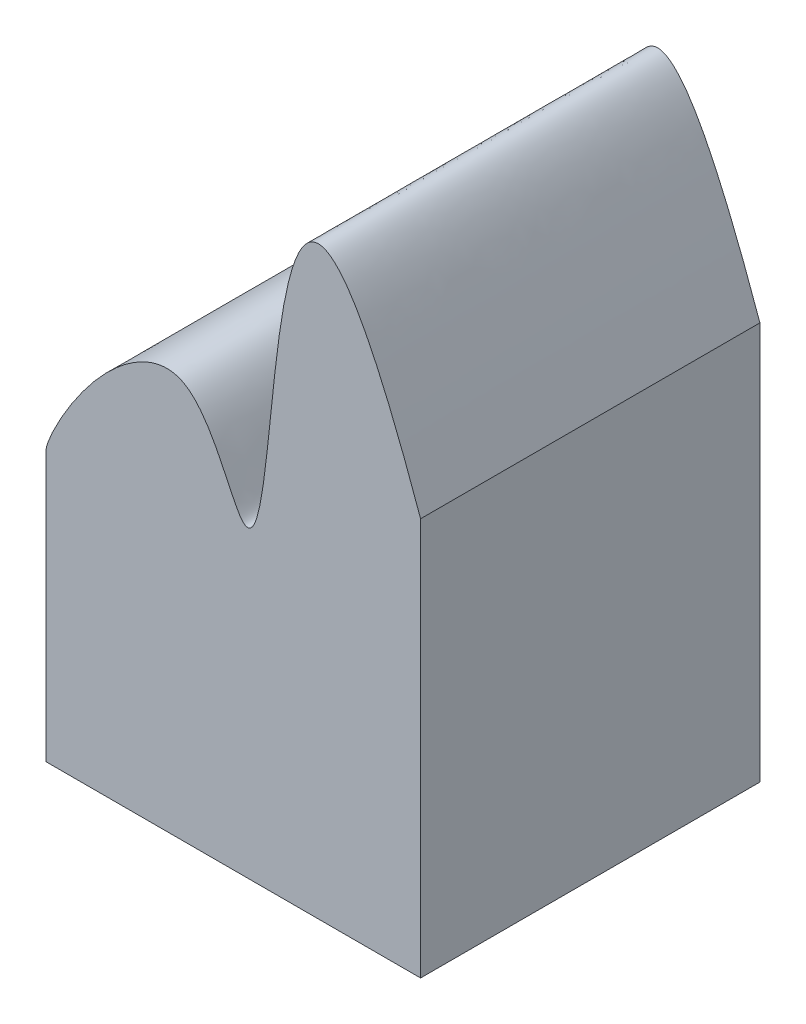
ISO-10303-21;
HEADER;
FILE_DESCRIPTION(('STEP AP214'),'2;1');
FILE_NAME('part.step','',(''),(''),'','','');
FILE_SCHEMA(('AUTOMOTIVE_DESIGN { 1 0 10303 214 1 1 1 1 }'));
ENDSEC;
DATA;
#1=APPLICATION_CONTEXT('core data for automotive mechanical design processes');
#2=APPLICATION_PROTOCOL_DEFINITION('international standard','automotive_design',2000,#1);
#3=PRODUCT_CONTEXT('',#1,'mechanical');
#4=PRODUCT('Part','Part','',(#3));
#5=PRODUCT_RELATED_PRODUCT_CATEGORY('part','',(#4));
#6=PRODUCT_DEFINITION_FORMATION('','',#4);
#7=PRODUCT_DEFINITION_CONTEXT('part definition',#1,'design');
#8=PRODUCT_DEFINITION('design','',#6,#7);
#9=PRODUCT_DEFINITION_SHAPE('','',#8);
#10=(LENGTH_UNIT() NAMED_UNIT(*) SI_UNIT(.MILLI.,.METRE.));
#11=(NAMED_UNIT(*) PLANE_ANGLE_UNIT() SI_UNIT($,.RADIAN.));
#12=(NAMED_UNIT(*) SI_UNIT($,.STERADIAN.) SOLID_ANGLE_UNIT());
#13=UNCERTAINTY_MEASURE_WITH_UNIT(LENGTH_MEASURE(1.E-05),#10,'distance_accuracy_value','');
#14=(GEOMETRIC_REPRESENTATION_CONTEXT(3) GLOBAL_UNCERTAINTY_ASSIGNED_CONTEXT((#13)) GLOBAL_UNIT_ASSIGNED_CONTEXT((#10,
#11,#12)) REPRESENTATION_CONTEXT('',''));
#15=CARTESIAN_POINT('',(0.,0.,0.));
#16=DIRECTION('',(0.,0.,1.));
#17=DIRECTION('',(1.,0.,0.));
#18=AXIS2_PLACEMENT_3D('',#15,#16,#17);
#19=CARTESIAN_POINT('',(86.0856413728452,91.4200080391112,39.));
#20=CARTESIAN_POINT('',(45.8843593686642,204.837680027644,39.));
#21=CARTESIAN_POINT('',(58.7095988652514,19.2774715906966,39.));
#22=CARTESIAN_POINT('',(34.5443905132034,99.3890920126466,39.));
#23=CARTESIAN_POINT('',(10.0186678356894,84.3079962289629,39.));
#24=CARTESIAN_POINT('',(0.,64.4051686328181,39.));
#25=CARTESIAN_POINT('',(0.,61.9890195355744,39.));
#26=B_SPLINE_CURVE_WITH_KNOTS('',3,(#19,#20,#21,#22,#23,#24,#25),.UNSPECIFIED.,.F.,.F.,(4,1,1,1,
4),(0.,0.58679061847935,0.733155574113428,0.852276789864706,1.),.UNSPECIFIED.);
#27=DIRECTION('',(0.,0.,-1.));
#28=VECTOR('',#27,1.);
#29=SURFACE_OF_LINEAR_EXTRUSION('',#26,#28);
#30=CARTESIAN_POINT('',(86.0856413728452,91.4200080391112,-39.));
#31=CARTESIAN_POINT('',(45.8843593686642,204.837680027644,-39.));
#32=CARTESIAN_POINT('',(58.7095988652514,19.2774715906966,-39.));
#33=CARTESIAN_POINT('',(34.5443905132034,99.3890920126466,-39.));
#34=CARTESIAN_POINT('',(10.0186678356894,84.3079962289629,-39.));
#35=CARTESIAN_POINT('',(0.,64.4051686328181,-39.));
#36=CARTESIAN_POINT('',(0.,61.9890195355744,-39.));
#37=B_SPLINE_CURVE_WITH_KNOTS('',3,(#30,#31,#32,#33,#34,#35,#36),.UNSPECIFIED.,.F.,.F.,(4,1,1,1,
4),(0.,0.58679061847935,0.733155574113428,0.852276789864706,1.),.UNSPECIFIED.);
#38=CARTESIAN_POINT('',(86.0856413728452,91.4200080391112,-39.));
#39=VERTEX_POINT('',#38);
#40=CARTESIAN_POINT('',(0.,61.9890195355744,-39.));
#41=VERTEX_POINT('',#40);
#42=EDGE_CURVE('E95',#39,#41,#37,.T.);
#43=ORIENTED_EDGE('',*,*,#42,.T.);
#44=DIRECTION('',(0.,0.,-1.));
#45=VECTOR('',#44,1.);
#46=CARTESIAN_POINT('',(0.,61.9890195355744,39.));
#47=LINE('',#46,#45);
#48=CARTESIAN_POINT('',(0.,61.9890195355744,39.));
#49=VERTEX_POINT('',#48);
#50=EDGE_CURVE('E11',#49,#41,#47,.T.);
#51=ORIENTED_EDGE('',*,*,#50,.F.);
#52=CARTESIAN_POINT('',(86.0856413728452,91.4200080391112,39.));
#53=VERTEX_POINT('',#52);
#54=EDGE_CURVE('E84',#53,#49,#26,.T.);
#55=ORIENTED_EDGE('',*,*,#54,.F.);
#56=DIRECTION('',(0.,0.,-1.));
#57=VECTOR('',#56,1.);
#58=CARTESIAN_POINT('',(86.0856413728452,91.4200080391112,39.));
#59=LINE('',#58,#57);
#60=EDGE_CURVE('E92',#53,#39,#59,.T.);
#61=ORIENTED_EDGE('',*,*,#60,.T.);
#62=EDGE_LOOP('',(#43,#51,#55,#61));
#63=FACE_BOUND('',#62,.T.);
#64=ADVANCED_FACE('F32',(#63),#29,.F.);
#65=CARTESIAN_POINT('',(0.,61.9890195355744,39.));
#66=DIRECTION('',(1.,0.,0.));
#67=DIRECTION('',(0.,0.,-1.));
#68=AXIS2_PLACEMENT_3D('',#65,#66,#67);
#69=PLANE('',#68);
#70=DIRECTION('',(0.,-1.,0.));
#71=VECTOR('',#70,1.);
#72=CARTESIAN_POINT('',(0.,61.9890195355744,-39.));
#73=LINE('',#72,#71);
#74=CARTESIAN_POINT('',(0.,0.,-39.));
#75=VERTEX_POINT('',#74);
#76=EDGE_CURVE('E88',#41,#75,#73,.T.);
#77=ORIENTED_EDGE('',*,*,#76,.T.);
#78=DIRECTION('',(0.,0.,-1.));
#79=VECTOR('',#78,1.);
#80=CARTESIAN_POINT('',(0.,0.,39.));
#81=LINE('',#80,#79);
#82=CARTESIAN_POINT('',(0.,0.,39.));
#83=VERTEX_POINT('',#82);
#84=EDGE_CURVE('E41',#83,#75,#81,.T.);
#85=ORIENTED_EDGE('',*,*,#84,.F.);
#86=DIRECTION('',(0.,-1.,0.));
#87=VECTOR('',#86,1.);
#88=CARTESIAN_POINT('',(0.,61.9890195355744,39.));
#89=LINE('',#88,#87);
#90=EDGE_CURVE('E79',#49,#83,#89,.T.);
#91=ORIENTED_EDGE('',*,*,#90,.F.);
#92=ORIENTED_EDGE('',*,*,#50,.T.);
#93=EDGE_LOOP('',(#77,#85,#91,#92));
#94=FACE_BOUND('',#93,.T.);
#95=ADVANCED_FACE('F87',(#94),#69,.F.);
#96=CARTESIAN_POINT('',(0.,0.,39.));
#97=DIRECTION('',(0.,1.,0.));
#98=DIRECTION('',(0.,0.,1.));
#99=AXIS2_PLACEMENT_3D('',#96,#97,#98);
#100=PLANE('',#99);
#101=DIRECTION('',(1.,0.,0.));
#102=VECTOR('',#101,1.);
#103=CARTESIAN_POINT('',(0.,0.,-39.));
#104=LINE('',#103,#102);
#105=CARTESIAN_POINT('',(86.0856413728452,0.,-39.));
#106=VERTEX_POINT('',#105);
#107=EDGE_CURVE('E66',#75,#106,#104,.T.);
#108=ORIENTED_EDGE('',*,*,#107,.T.);
#109=DIRECTION('',(0.,0.,-1.));
#110=VECTOR('',#109,1.);
#111=CARTESIAN_POINT('',(86.0856413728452,0.,39.));
#112=LINE('',#111,#110);
#113=CARTESIAN_POINT('',(86.0856413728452,0.,39.));
#114=VERTEX_POINT('',#113);
#115=EDGE_CURVE('E89',#114,#106,#112,.T.);
#116=ORIENTED_EDGE('',*,*,#115,.F.);
#117=DIRECTION('',(1.,0.,0.));
#118=VECTOR('',#117,1.);
#119=CARTESIAN_POINT('',(0.,0.,39.));
#120=LINE('',#119,#118);
#121=EDGE_CURVE('E82',#83,#114,#120,.T.);
#122=ORIENTED_EDGE('',*,*,#121,.F.);
#123=ORIENTED_EDGE('',*,*,#84,.T.);
#124=EDGE_LOOP('',(#108,#116,#122,#123));
#125=FACE_BOUND('',#124,.T.);
#126=ADVANCED_FACE('F90',(#125),#100,.F.);
#127=CARTESIAN_POINT('',(86.0856413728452,0.,39.));
#128=DIRECTION('',(-1.,0.,0.));
#129=DIRECTION('',(0.,0.,1.));
#130=AXIS2_PLACEMENT_3D('',#127,#128,#129);
#131=PLANE('',#130);
#132=DIRECTION('',(0.,1.,0.));
#133=VECTOR('',#132,1.);
#134=CARTESIAN_POINT('',(86.0856413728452,0.,-39.));
#135=LINE('',#134,#133);
#136=EDGE_CURVE('E72',#106,#39,#135,.T.);
#137=ORIENTED_EDGE('',*,*,#136,.T.);
#138=ORIENTED_EDGE('',*,*,#60,.F.);
#139=DIRECTION('',(0.,1.,0.));
#140=VECTOR('',#139,1.);
#141=CARTESIAN_POINT('',(86.0856413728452,0.,39.));
#142=LINE('',#141,#140);
#143=EDGE_CURVE('E49',#114,#53,#142,.T.);
#144=ORIENTED_EDGE('',*,*,#143,.F.);
#145=ORIENTED_EDGE('',*,*,#115,.T.);
#146=EDGE_LOOP('',(#137,#138,#144,#145));
#147=FACE_BOUND('',#146,.T.);
#148=ADVANCED_FACE('F107',(#147),#131,.F.);
#149=CARTESIAN_POINT('',(48.701488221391,73.7094636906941,39.));
#150=DIRECTION('',(0.,0.,-1.));
#151=DIRECTION('',(-1.,0.,0.));
#152=AXIS2_PLACEMENT_3D('',#149,#150,#151);
#153=PLANE('',#152);
#154=ORIENTED_EDGE('',*,*,#54,.T.);
#155=ORIENTED_EDGE('',*,*,#90,.T.);
#156=ORIENTED_EDGE('',*,*,#121,.T.);
#157=ORIENTED_EDGE('',*,*,#143,.T.);
#158=EDGE_LOOP('',(#154,#155,#156,#157));
#159=FACE_BOUND('',#158,.T.);
#160=ADVANCED_FACE('F80',(#159),#153,.F.);
#161=CARTESIAN_POINT('',(48.701488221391,73.7094636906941,-39.));
#162=DIRECTION('',(0.,0.,-1.));
#163=DIRECTION('',(-1.,0.,0.));
#164=AXIS2_PLACEMENT_3D('',#161,#162,#163);
#165=PLANE('',#164);
#166=ORIENTED_EDGE('',*,*,#42,.F.);
#167=ORIENTED_EDGE('',*,*,#136,.F.);
#168=ORIENTED_EDGE('',*,*,#107,.F.);
#169=ORIENTED_EDGE('',*,*,#76,.F.);
#170=EDGE_LOOP('',(#166,#167,#168,#169));
#171=FACE_BOUND('',#170,.T.);
#172=ADVANCED_FACE('F110',(#171),#165,.T.);
#173=CLOSED_SHELL('',(#64,#95,#126,#148,#160,#172));
#174=MANIFOLD_SOLID_BREP('B2',#173);
#175=ADVANCED_BREP_SHAPE_REPRESENTATION('',(#18,#174),#14);
#176=SHAPE_DEFINITION_REPRESENTATION(#9,#175);
ENDSEC;
END-ISO-10303-21;
